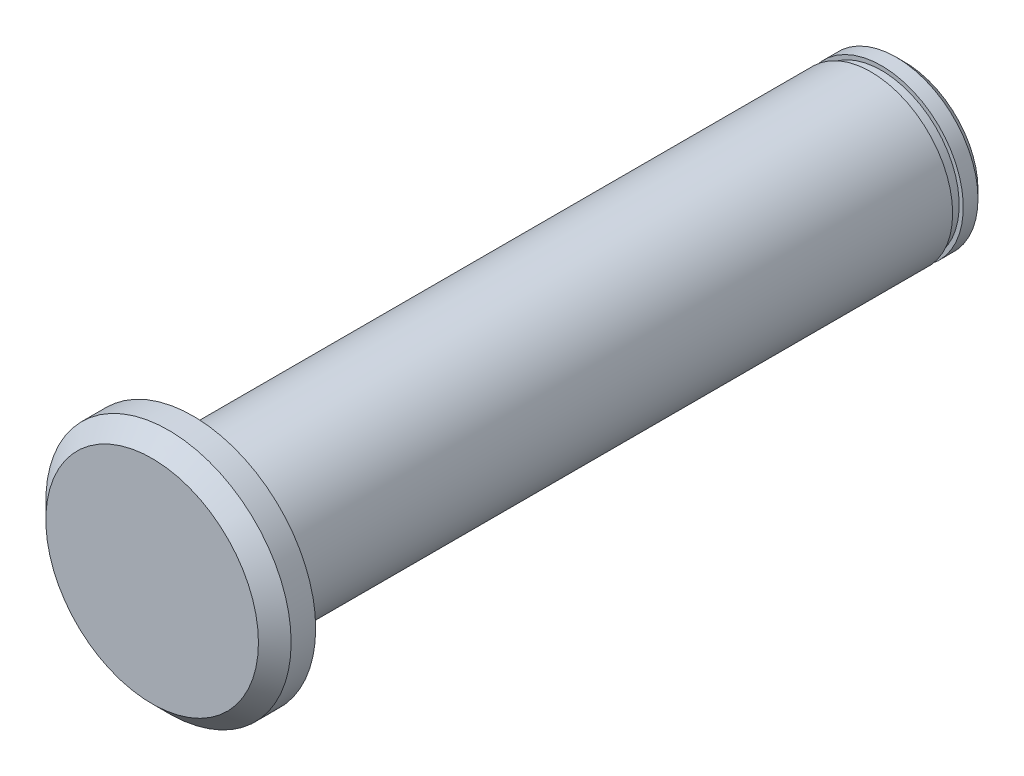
ISO-10303-21;
HEADER;
FILE_DESCRIPTION(('STEP AP214'),'2;1');
FILE_NAME('part.step','',(''),(''),'','','');
FILE_SCHEMA(('AUTOMOTIVE_DESIGN { 1 0 10303 214 1 1 1 1 }'));
ENDSEC;
DATA;
#1=APPLICATION_CONTEXT('core data for automotive mechanical design processes');
#2=APPLICATION_PROTOCOL_DEFINITION('international standard','automotive_design',2000,#1);
#3=PRODUCT_CONTEXT('',#1,'mechanical');
#4=PRODUCT('Part','Part','',(#3));
#5=PRODUCT_RELATED_PRODUCT_CATEGORY('part','',(#4));
#6=PRODUCT_DEFINITION_FORMATION('','',#4);
#7=PRODUCT_DEFINITION_CONTEXT('part definition',#1,'design');
#8=PRODUCT_DEFINITION('design','',#6,#7);
#9=PRODUCT_DEFINITION_SHAPE('','',#8);
#10=(LENGTH_UNIT() NAMED_UNIT(*) SI_UNIT(.MILLI.,.METRE.));
#11=(NAMED_UNIT(*) PLANE_ANGLE_UNIT() SI_UNIT($,.RADIAN.));
#12=(NAMED_UNIT(*) SI_UNIT($,.STERADIAN.) SOLID_ANGLE_UNIT());
#13=UNCERTAINTY_MEASURE_WITH_UNIT(LENGTH_MEASURE(1.E-05),#10,'distance_accuracy_value','');
#14=(GEOMETRIC_REPRESENTATION_CONTEXT(3) GLOBAL_UNCERTAINTY_ASSIGNED_CONTEXT((#13)) GLOBAL_UNIT_ASSIGNED_CONTEXT((#10,
#11,#12)) REPRESENTATION_CONTEXT('',''));
#15=CARTESIAN_POINT('',(0.,0.,0.));
#16=DIRECTION('',(0.,0.,1.));
#17=DIRECTION('',(1.,0.,0.));
#18=AXIS2_PLACEMENT_3D('',#15,#16,#17);
#19=CARTESIAN_POINT('',(0.,0.,87.));
#20=DIRECTION('',(0.,0.,-1.));
#21=DIRECTION('',(-1.,0.,0.));
#22=AXIS2_PLACEMENT_3D('',#19,#20,#21);
#23=CYLINDRICAL_SURFACE('',#22,10.);
#24=CARTESIAN_POINT('',(0.,0.,4.09999999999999));
#25=DIRECTION('',(0.,0.,1.));
#26=DIRECTION('',(1.,0.,0.));
#27=AXIS2_PLACEMENT_3D('',#24,#25,#26);
#28=CIRCLE('',#27,10.);
#29=CARTESIAN_POINT('',(10.,0.,4.09999999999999));
#30=VERTEX_POINT('',#29);
#31=EDGE_CURVE('E46',#30,#30,#28,.T.);
#32=ORIENTED_EDGE('',*,*,#31,.T.);
#33=EDGE_LOOP('',(#32));
#34=FACE_BOUND('',#33,.T.);
#35=CARTESIAN_POINT('',(0.,0.,87.));
#36=DIRECTION('',(0.,0.,1.));
#37=DIRECTION('',(1.,0.,0.));
#38=AXIS2_PLACEMENT_3D('',#35,#36,#37);
#39=CIRCLE('',#38,10.);
#40=CARTESIAN_POINT('',(10.,0.,87.));
#41=VERTEX_POINT('',#40);
#42=EDGE_CURVE('E56',#41,#41,#39,.T.);
#43=ORIENTED_EDGE('',*,*,#42,.F.);
#44=EDGE_LOOP('',(#43));
#45=FACE_BOUND('',#44,.T.);
#46=ADVANCED_FACE('F28',(#34,#45),#23,.T.);
#47=CARTESIAN_POINT('',(0.,0.,87.));
#48=DIRECTION('',(0.,0.,1.));
#49=DIRECTION('',(1.,0.,0.));
#50=AXIS2_PLACEMENT_3D('',#47,#48,#49);
#51=PLANE('',#50);
#52=CARTESIAN_POINT('',(0.,0.,87.));
#53=DIRECTION('',(0.,0.,1.));
#54=DIRECTION('',(1.,0.,0.));
#55=AXIS2_PLACEMENT_3D('',#52,#53,#54);
#56=CIRCLE('',#55,15.);
#57=CARTESIAN_POINT('',(15.,0.,87.));
#58=VERTEX_POINT('',#57);
#59=EDGE_CURVE('E49',#58,#58,#56,.T.);
#60=ORIENTED_EDGE('',*,*,#59,.F.);
#61=EDGE_LOOP('',(#60));
#62=FACE_BOUND('',#61,.T.);
#63=ORIENTED_EDGE('',*,*,#42,.T.);
#64=EDGE_LOOP('',(#63));
#65=FACE_BOUND('',#64,.T.);
#66=ADVANCED_FACE('F86',(#62,#65),#51,.F.);
#67=CARTESIAN_POINT('',(0.,0.,92.));
#68=DIRECTION('',(0.,0.,-1.));
#69=DIRECTION('',(-1.,0.,0.));
#70=AXIS2_PLACEMENT_3D('',#67,#68,#69);
#71=CYLINDRICAL_SURFACE('',#70,15.);
#72=CARTESIAN_POINT('',(0.,0.,90.));
#73=DIRECTION('',(0.,0.,1.));
#74=DIRECTION('',(1.,0.,0.));
#75=AXIS2_PLACEMENT_3D('',#72,#73,#74);
#76=CIRCLE('',#75,15.);
#77=CARTESIAN_POINT('',(15.,0.,90.));
#78=VERTEX_POINT('',#77);
#79=EDGE_CURVE('E39',#78,#78,#76,.F.);
#80=ORIENTED_EDGE('',*,*,#79,.T.);
#81=EDGE_LOOP('',(#80));
#82=FACE_BOUND('',#81,.T.);
#83=ORIENTED_EDGE('',*,*,#59,.T.);
#84=EDGE_LOOP('',(#83));
#85=FACE_BOUND('',#84,.T.);
#86=ADVANCED_FACE('F92',(#82,#85),#71,.T.);
#87=CARTESIAN_POINT('',(0.,0.,92.));
#88=DIRECTION('',(0.,0.,1.));
#89=DIRECTION('',(1.,0.,0.));
#90=AXIS2_PLACEMENT_3D('',#87,#88,#89);
#91=PLANE('',#90);
#92=CARTESIAN_POINT('',(0.,0.,92.));
#93=DIRECTION('',(0.,0.,1.));
#94=DIRECTION('',(1.,0.,0.));
#95=AXIS2_PLACEMENT_3D('',#92,#93,#94);
#96=CIRCLE('',#95,13.);
#97=CARTESIAN_POINT('',(13.,0.,92.));
#98=VERTEX_POINT('',#97);
#99=EDGE_CURVE('E43',#98,#98,#96,.T.);
#100=ORIENTED_EDGE('',*,*,#99,.T.);
#101=EDGE_LOOP('',(#100));
#102=FACE_BOUND('',#101,.T.);
#103=ADVANCED_FACE('F98',(#102),#91,.T.);
#104=CARTESIAN_POINT('',(0.,0.,92.));
#105=DIRECTION('',(0.,0.,-1.));
#106=DIRECTION('',(-1.,0.,0.));
#107=AXIS2_PLACEMENT_3D('',#104,#105,#106);
#108=CONICAL_SURFACE('',#107,13.,0.785398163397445);
#109=ORIENTED_EDGE('',*,*,#79,.F.);
#110=EDGE_LOOP('',(#109));
#111=FACE_BOUND('',#110,.T.);
#112=ORIENTED_EDGE('',*,*,#99,.F.);
#113=EDGE_LOOP('',(#112));
#114=FACE_BOUND('',#113,.T.);
#115=ADVANCED_FACE('F80',(#111,#114),#108,.T.);
#116=CARTESIAN_POINT('',(0.,13.8106987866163,4.1));
#117=DIRECTION('',(0.,0.,1.));
#118=DIRECTION('',(1.,0.,0.));
#119=AXIS2_PLACEMENT_3D('',#116,#117,#118);
#120=PLANE('',#119);
#121=CARTESIAN_POINT('',(0.,0.,4.1));
#122=DIRECTION('',(0.,0.,-1.));
#123=DIRECTION('',(-1.,0.,0.));
#124=AXIS2_PLACEMENT_3D('',#121,#122,#123);
#125=CIRCLE('',#124,9.5);
#126=CARTESIAN_POINT('',(-9.5,0.,4.1));
#127=VERTEX_POINT('',#126);
#128=EDGE_CURVE('E52',#127,#127,#125,.T.);
#129=ORIENTED_EDGE('',*,*,#128,.F.);
#130=EDGE_LOOP('',(#129));
#131=FACE_BOUND('',#130,.T.);
#132=ORIENTED_EDGE('',*,*,#31,.F.);
#133=EDGE_LOOP('',(#132));
#134=FACE_BOUND('',#133,.T.);
#135=ADVANCED_FACE('F77',(#131,#134),#120,.F.);
#136=CARTESIAN_POINT('',(0.,13.8106987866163,2.8));
#137=DIRECTION('',(0.,0.,-1.));
#138=DIRECTION('',(-1.,0.,0.));
#139=AXIS2_PLACEMENT_3D('',#136,#137,#138);
#140=PLANE('',#139);
#141=CARTESIAN_POINT('',(0.,0.,2.8));
#142=DIRECTION('',(0.,0.,-1.));
#143=DIRECTION('',(-1.,0.,0.));
#144=AXIS2_PLACEMENT_3D('',#141,#142,#143);
#145=CIRCLE('',#144,9.5);
#146=CARTESIAN_POINT('',(-9.5,0.,2.8));
#147=VERTEX_POINT('',#146);
#148=EDGE_CURVE('E63',#147,#147,#145,.T.);
#149=ORIENTED_EDGE('',*,*,#148,.T.);
#150=EDGE_LOOP('',(#149));
#151=FACE_BOUND('',#150,.T.);
#152=CARTESIAN_POINT('',(0.,0.,2.8));
#153=DIRECTION('',(0.,0.,-1.));
#154=DIRECTION('',(-1.,0.,0.));
#155=AXIS2_PLACEMENT_3D('',#152,#153,#154);
#156=CIRCLE('',#155,10.);
#157=CARTESIAN_POINT('',(-10.,0.,2.8));
#158=VERTEX_POINT('',#157);
#159=EDGE_CURVE('E50',#158,#158,#156,.T.);
#160=ORIENTED_EDGE('',*,*,#159,.F.);
#161=EDGE_LOOP('',(#160));
#162=FACE_BOUND('',#161,.T.);
#163=ADVANCED_FACE('F67',(#151,#162),#140,.F.);
#164=CARTESIAN_POINT('',(0.,0.,0.));
#165=DIRECTION('',(0.,0.,-1.));
#166=DIRECTION('',(-1.,0.,0.));
#167=AXIS2_PLACEMENT_3D('',#164,#165,#166);
#168=CYLINDRICAL_SURFACE('',#167,9.5);
#169=ORIENTED_EDGE('',*,*,#148,.F.);
#170=EDGE_LOOP('',(#169));
#171=FACE_BOUND('',#170,.T.);
#172=ORIENTED_EDGE('',*,*,#128,.T.);
#173=EDGE_LOOP('',(#172));
#174=FACE_BOUND('',#173,.T.);
#175=ADVANCED_FACE('F70',(#171,#174),#168,.T.);
#176=CARTESIAN_POINT('',(0.,0.,0.));
#177=DIRECTION('',(0.,0.,1.));
#178=DIRECTION('',(1.,0.,0.));
#179=AXIS2_PLACEMENT_3D('',#176,#177,#178);
#180=PLANE('',#179);
#181=CARTESIAN_POINT('',(0.,0.,0.));
#182=DIRECTION('',(0.,0.,1.));
#183=DIRECTION('',(1.,0.,0.));
#184=AXIS2_PLACEMENT_3D('',#181,#182,#183);
#185=CIRCLE('',#184,9.00000000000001);
#186=CARTESIAN_POINT('',(9.00000000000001,0.,0.));
#187=VERTEX_POINT('',#186);
#188=EDGE_CURVE('E10',#187,#187,#185,.F.);
#189=ORIENTED_EDGE('',*,*,#188,.T.);
#190=EDGE_LOOP('',(#189));
#191=FACE_BOUND('',#190,.T.);
#192=ADVANCED_FACE('F73',(#191),#180,.F.);
#193=CARTESIAN_POINT('',(0.,0.,0.999999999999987));
#194=DIRECTION('',(0.,0.,1.));
#195=DIRECTION('',(1.,0.,0.));
#196=AXIS2_PLACEMENT_3D('',#193,#194,#195);
#197=CIRCLE('',#196,10.);
#198=CARTESIAN_POINT('',(10.,0.,0.999999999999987));
#199=VERTEX_POINT('',#198);
#200=EDGE_CURVE('E35',#199,#199,#197,.T.);
#201=ORIENTED_EDGE('',*,*,#200,.T.);
#202=EDGE_LOOP('',(#201));
#203=FACE_BOUND('',#202,.T.);
#204=ORIENTED_EDGE('',*,*,#159,.T.);
#205=EDGE_LOOP('',(#204));
#206=FACE_BOUND('',#205,.T.);
#207=ADVANCED_FACE('F88',(#203,#206),#23,.T.);
#208=CARTESIAN_POINT('',(0.,0.,0.999999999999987));
#209=DIRECTION('',(0.,0.,1.));
#210=DIRECTION('',(1.,0.,0.));
#211=AXIS2_PLACEMENT_3D('',#208,#209,#210);
#212=CONICAL_SURFACE('',#211,10.,0.785398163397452);
#213=ORIENTED_EDGE('',*,*,#188,.F.);
#214=EDGE_LOOP('',(#213));
#215=FACE_BOUND('',#214,.T.);
#216=ORIENTED_EDGE('',*,*,#200,.F.);
#217=EDGE_LOOP('',(#216));
#218=FACE_BOUND('',#217,.T.);
#219=ADVANCED_FACE('F30',(#215,#218),#212,.T.);
#220=CLOSED_SHELL('',(#46,#66,#86,#103,#115,#135,#163,#175,#192,#207,#219));
#221=MANIFOLD_SOLID_BREP('B2',#220);
#222=ADVANCED_BREP_SHAPE_REPRESENTATION('',(#18,#221),#14);
#223=SHAPE_DEFINITION_REPRESENTATION(#9,#222);
ENDSEC;
END-ISO-10303-21;
